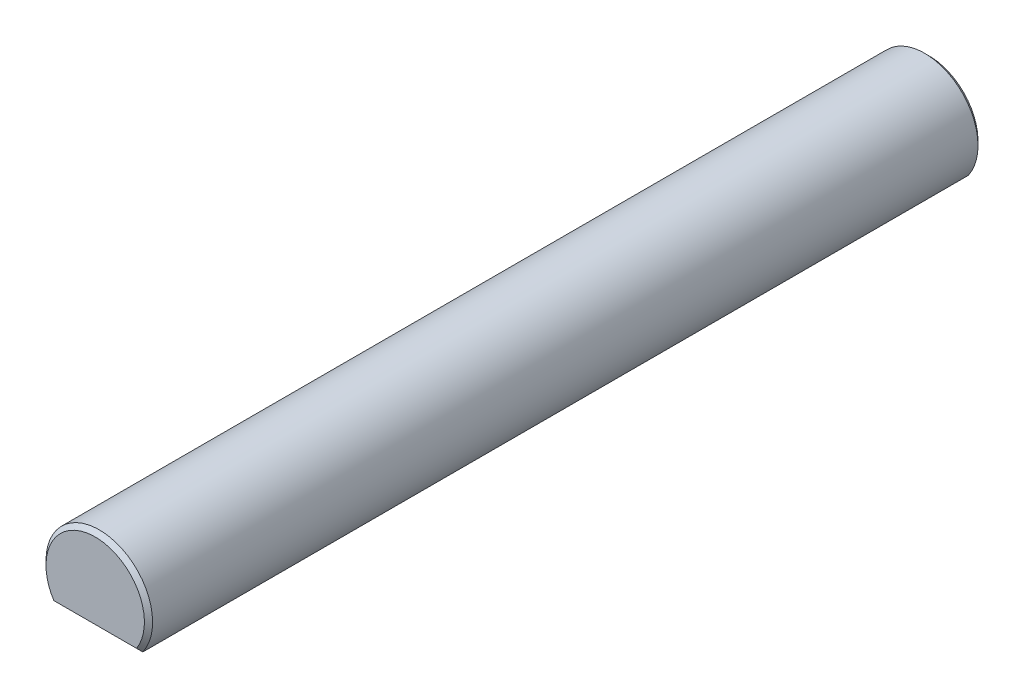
ISO-10303-21;
HEADER;
FILE_DESCRIPTION(('STEP AP214'),'2;1');
FILE_NAME('part.step','',(''),(''),'','','');
FILE_SCHEMA(('AUTOMOTIVE_DESIGN { 1 0 10303 214 1 1 1 1 }'));
ENDSEC;
DATA;
#1=APPLICATION_CONTEXT('core data for automotive mechanical design processes');
#2=APPLICATION_PROTOCOL_DEFINITION('international standard','automotive_design',2000,#1);
#3=PRODUCT_CONTEXT('',#1,'mechanical');
#4=PRODUCT('Part','Part','',(#3));
#5=PRODUCT_RELATED_PRODUCT_CATEGORY('part','',(#4));
#6=PRODUCT_DEFINITION_FORMATION('','',#4);
#7=PRODUCT_DEFINITION_CONTEXT('part definition',#1,'design');
#8=PRODUCT_DEFINITION('design','',#6,#7);
#9=PRODUCT_DEFINITION_SHAPE('','',#8);
#10=(LENGTH_UNIT() NAMED_UNIT(*) SI_UNIT(.MILLI.,.METRE.));
#11=(NAMED_UNIT(*) PLANE_ANGLE_UNIT() SI_UNIT($,.RADIAN.));
#12=(NAMED_UNIT(*) SI_UNIT($,.STERADIAN.) SOLID_ANGLE_UNIT());
#13=UNCERTAINTY_MEASURE_WITH_UNIT(LENGTH_MEASURE(1.E-05),#10,'distance_accuracy_value','');
#14=(GEOMETRIC_REPRESENTATION_CONTEXT(3) GLOBAL_UNCERTAINTY_ASSIGNED_CONTEXT((#13)) GLOBAL_UNIT_ASSIGNED_CONTEXT((#10,
#11,#12)) REPRESENTATION_CONTEXT('',''));
#15=CARTESIAN_POINT('',(0.,0.,0.));
#16=DIRECTION('',(0.,0.,1.));
#17=DIRECTION('',(1.,0.,0.));
#18=AXIS2_PLACEMENT_3D('',#15,#16,#17);
#19=CARTESIAN_POINT('',(0.,0.,122.));
#20=DIRECTION('',(0.,0.,-1.));
#21=DIRECTION('',(-1.,0.,0.));
#22=AXIS2_PLACEMENT_3D('',#19,#20,#21);
#23=CYLINDRICAL_SURFACE('',#22,7.8);
#24=DIRECTION('',(0.,0.,-1.));
#25=VECTOR('',#24,1.);
#26=CARTESIAN_POINT('',(6.37102817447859,-4.5,122.));
#27=LINE('',#26,#25);
#28=CARTESIAN_POINT('',(6.37102817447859,-4.5,121.4));
#29=VERTEX_POINT('',#28);
#30=CARTESIAN_POINT('',(6.37102817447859,-4.5,0.600000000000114));
#31=VERTEX_POINT('',#30);
#32=EDGE_CURVE('E87',#29,#31,#27,.T.);
#33=ORIENTED_EDGE('',*,*,#32,.T.);
#34=CARTESIAN_POINT('',(0.,0.,0.600000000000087));
#35=DIRECTION('',(0.,0.,1.));
#36=DIRECTION('',(1.,0.,0.));
#37=AXIS2_PLACEMENT_3D('',#34,#35,#36);
#38=CIRCLE('',#37,7.8);
#39=CARTESIAN_POINT('',(-6.37102817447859,-4.5,0.600000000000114));
#40=VERTEX_POINT('',#39);
#41=EDGE_CURVE('E92',#31,#40,#38,.T.);
#42=ORIENTED_EDGE('',*,*,#41,.T.);
#43=DIRECTION('',(0.,0.,-1.));
#44=VECTOR('',#43,1.);
#45=CARTESIAN_POINT('',(-6.37102817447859,-4.5,122.));
#46=LINE('',#45,#44);
#47=CARTESIAN_POINT('',(-6.37102817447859,-4.5,121.4));
#48=VERTEX_POINT('',#47);
#49=EDGE_CURVE('E89',#48,#40,#46,.T.);
#50=ORIENTED_EDGE('',*,*,#49,.F.);
#51=CARTESIAN_POINT('',(0.,0.,121.4));
#52=DIRECTION('',(0.,0.,1.));
#53=DIRECTION('',(1.,0.,0.));
#54=AXIS2_PLACEMENT_3D('',#51,#52,#53);
#55=CIRCLE('',#54,7.8);
#56=EDGE_CURVE('E85',#48,#29,#55,.F.);
#57=ORIENTED_EDGE('',*,*,#56,.T.);
#58=EDGE_LOOP('',(#33,#42,#50,#57));
#59=FACE_BOUND('',#58,.T.);
#60=ADVANCED_FACE('F35',(#59),#23,.T.);
#61=CARTESIAN_POINT('',(-6.37102817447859,-4.5,122.));
#62=DIRECTION('',(0.,1.,0.));
#63=DIRECTION('',(0.,0.,1.));
#64=AXIS2_PLACEMENT_3D('',#61,#62,#63);
#65=PLANE('',#64);
#66=ORIENTED_EDGE('',*,*,#49,.T.);
#67=DIRECTION('',(1.,0.,0.));
#68=VECTOR('',#67,1.);
#69=CARTESIAN_POINT('',(-6.37102817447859,-4.5,0.600000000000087));
#70=LINE('',#69,#68);
#71=EDGE_CURVE('E100',#40,#31,#70,.T.);
#72=ORIENTED_EDGE('',*,*,#71,.T.);
#73=ORIENTED_EDGE('',*,*,#32,.F.);
#74=DIRECTION('',(-1.,0.,0.));
#75=VECTOR('',#74,1.);
#76=CARTESIAN_POINT('',(-6.37102817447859,-4.5,121.4));
#77=LINE('',#76,#75);
#78=EDGE_CURVE('E98',#29,#48,#77,.T.);
#79=ORIENTED_EDGE('',*,*,#78,.T.);
#80=EDGE_LOOP('',(#66,#72,#73,#79));
#81=FACE_BOUND('',#80,.T.);
#82=ADVANCED_FACE('F97',(#81),#65,.F.);
#83=CARTESIAN_POINT('',(0.,0.,122.));
#84=DIRECTION('',(0.,0.,1.));
#85=DIRECTION('',(1.,0.,0.));
#86=AXIS2_PLACEMENT_3D('',#83,#84,#85);
#87=PLANE('',#86);
#88=CARTESIAN_POINT('',(0.,0.,122.));
#89=DIRECTION('',(0.,0.,1.));
#90=DIRECTION('',(1.,0.,0.));
#91=AXIS2_PLACEMENT_3D('',#88,#89,#90);
#92=CIRCLE('',#91,7.20000000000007);
#93=CARTESIAN_POINT('',(6.05227230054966,-3.90000000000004,122.));
#94=VERTEX_POINT('',#93);
#95=CARTESIAN_POINT('',(-6.05227230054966,-3.90000000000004,122.));
#96=VERTEX_POINT('',#95);
#97=EDGE_CURVE('E50',#94,#96,#92,.T.);
#98=ORIENTED_EDGE('',*,*,#97,.T.);
#99=DIRECTION('',(1.,0.,0.));
#100=VECTOR('',#99,1.);
#101=CARTESIAN_POINT('',(6.37102817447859,-3.90000000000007,122.));
#102=LINE('',#101,#100);
#103=EDGE_CURVE('E11',#96,#94,#102,.T.);
#104=ORIENTED_EDGE('',*,*,#103,.T.);
#105=EDGE_LOOP('',(#98,#104));
#106=FACE_BOUND('',#105,.T.);
#107=ADVANCED_FACE('F157',(#106),#87,.T.);
#108=CARTESIAN_POINT('',(0.,0.,0.));
#109=DIRECTION('',(0.,0.,1.));
#110=DIRECTION('',(1.,0.,0.));
#111=AXIS2_PLACEMENT_3D('',#108,#109,#110);
#112=PLANE('',#111);
#113=CARTESIAN_POINT('',(0.,0.,0.));
#114=DIRECTION('',(0.,0.,1.));
#115=DIRECTION('',(1.,0.,0.));
#116=AXIS2_PLACEMENT_3D('',#113,#114,#115);
#117=CIRCLE('',#116,7.19999999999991);
#118=CARTESIAN_POINT('',(-6.05227230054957,-3.89999999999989,0.));
#119=VERTEX_POINT('',#118);
#120=CARTESIAN_POINT('',(6.05227230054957,-3.89999999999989,0.));
#121=VERTEX_POINT('',#120);
#122=EDGE_CURVE('E145',#119,#121,#117,.F.);
#123=ORIENTED_EDGE('',*,*,#122,.T.);
#124=DIRECTION('',(-1.,0.,0.));
#125=VECTOR('',#124,1.);
#126=CARTESIAN_POINT('',(0.,-3.89999999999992,0.));
#127=LINE('',#126,#125);
#128=EDGE_CURVE('E93',#121,#119,#127,.T.);
#129=ORIENTED_EDGE('',*,*,#128,.T.);
#130=EDGE_LOOP('',(#123,#129));
#131=FACE_BOUND('',#130,.T.);
#132=ADVANCED_FACE('F155',(#131),#112,.F.);
#133=CARTESIAN_POINT('',(0.,0.,0.600000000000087));
#134=DIRECTION('',(0.,0.,1.));
#135=DIRECTION('',(1.,0.,0.));
#136=AXIS2_PLACEMENT_3D('',#133,#134,#135);
#137=CONICAL_SURFACE('',#136,7.8,0.785398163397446);
#138=CARTESIAN_POINT('',(6.37102817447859,-4.5,0.600000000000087));
#139=CARTESIAN_POINT('',(6.31909661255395,-4.39968280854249,0.499682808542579));
#140=CARTESIAN_POINT('',(6.26656786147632,-4.2995242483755,0.399524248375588));
#141=CARTESIAN_POINT('',(6.16031590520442,-4.09952424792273,0.199524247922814));
#142=CARTESIAN_POINT('',(6.10659269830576,-3.99968280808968,0.0996828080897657));
#143=CARTESIAN_POINT('',(6.05227230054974,-3.89999999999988,0.));
#144=B_SPLINE_CURVE_WITH_KNOTS('',3,(#138,#139,#140,#141,#142,#143),.UNSPECIFIED.,.F.,.F.,(4,2,
4),(0.,0.453215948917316,0.906432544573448),.UNSPECIFIED.);
#145=EDGE_CURVE('E105',#121,#31,#144,.F.);
#146=ORIENTED_EDGE('',*,*,#145,.F.);
#147=ORIENTED_EDGE('',*,*,#122,.F.);
#148=CARTESIAN_POINT('',(-6.05227230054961,-3.89999999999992,0.));
#149=CARTESIAN_POINT('',(-6.10659269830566,-3.99968280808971,0.0996828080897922));
#150=CARTESIAN_POINT('',(-6.16031590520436,-4.09952424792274,0.199524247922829));
#151=CARTESIAN_POINT('',(-6.26656786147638,-4.29952424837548,0.39952424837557));
#152=CARTESIAN_POINT('',(-6.31909661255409,-4.39968280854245,0.49968280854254));
#153=CARTESIAN_POINT('',(-6.37102817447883,-4.49999999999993,0.60000000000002));
#154=B_SPLINE_CURVE_WITH_KNOTS('',3,(#148,#149,#150,#151,#152,#153),.UNSPECIFIED.,.F.,.F.,(4,2,
4),(0.,0.45321659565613,0.906432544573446),.UNSPECIFIED.);
#155=EDGE_CURVE('E101',#40,#119,#154,.F.);
#156=ORIENTED_EDGE('',*,*,#155,.F.);
#157=ORIENTED_EDGE('',*,*,#41,.F.);
#158=EDGE_LOOP('',(#146,#147,#156,#157));
#159=FACE_BOUND('',#158,.T.);
#160=ADVANCED_FACE('F131',(#159),#137,.T.);
#161=CARTESIAN_POINT('',(-6.37102817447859,-4.5,0.600000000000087));
#162=DIRECTION('',(0.,0.707106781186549,0.707106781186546));
#163=DIRECTION('',(1.,0.,0.));
#164=AXIS2_PLACEMENT_3D('',#161,#162,#163);
#165=PLANE('',#164);
#166=ORIENTED_EDGE('',*,*,#155,.T.);
#167=ORIENTED_EDGE('',*,*,#128,.F.);
#168=ORIENTED_EDGE('',*,*,#145,.T.);
#169=ORIENTED_EDGE('',*,*,#71,.F.);
#170=EDGE_LOOP('',(#166,#167,#168,#169));
#171=FACE_BOUND('',#170,.T.);
#172=ADVANCED_FACE('F123',(#171),#165,.F.);
#173=CARTESIAN_POINT('',(0.,0.,122.));
#174=DIRECTION('',(0.,0.,-1.));
#175=DIRECTION('',(-1.,0.,0.));
#176=AXIS2_PLACEMENT_3D('',#173,#174,#175);
#177=CONICAL_SURFACE('',#176,7.20000000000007,0.785398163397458);
#178=CARTESIAN_POINT('',(6.0522723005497,-3.90000000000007,122.));
#179=CARTESIAN_POINT('',(6.10659269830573,-3.99968280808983,121.90031719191));
#180=CARTESIAN_POINT('',(6.16031590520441,-4.09952424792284,121.800475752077));
#181=CARTESIAN_POINT('',(6.26656786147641,-4.29952424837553,121.600475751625));
#182=CARTESIAN_POINT('',(6.3190966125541,-4.39968280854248,121.500317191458));
#183=CARTESIAN_POINT('',(6.37102817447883,-4.49999999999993,121.4));
#184=B_SPLINE_CURVE_WITH_KNOTS('',3,(#178,#179,#180,#181,#182,#183),.UNSPECIFIED.,.F.,.F.,(4,2,
4),(0.,0.453216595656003,0.906432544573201),.UNSPECIFIED.);
#185=EDGE_CURVE('E63',#29,#94,#184,.F.);
#186=ORIENTED_EDGE('',*,*,#185,.F.);
#187=ORIENTED_EDGE('',*,*,#56,.F.);
#188=CARTESIAN_POINT('',(-6.37102817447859,-4.5,121.4));
#189=CARTESIAN_POINT('',(-6.31909661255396,-4.39968280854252,121.500317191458));
#190=CARTESIAN_POINT('',(-6.26656786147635,-4.29952424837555,121.600475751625));
#191=CARTESIAN_POINT('',(-6.16031590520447,-4.09952424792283,121.800475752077));
#192=CARTESIAN_POINT('',(-6.10659269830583,-3.99968280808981,121.90031719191));
#193=CARTESIAN_POINT('',(-6.05227230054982,-3.90000000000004,122.));
#194=B_SPLINE_CURVE_WITH_KNOTS('',3,(#188,#189,#190,#191,#192,#193),.UNSPECIFIED.,.F.,.F.,(4,2,
4),(0.,0.453215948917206,0.906432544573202),.UNSPECIFIED.);
#195=EDGE_CURVE('E41',#96,#48,#194,.F.);
#196=ORIENTED_EDGE('',*,*,#195,.F.);
#197=ORIENTED_EDGE('',*,*,#97,.F.);
#198=EDGE_LOOP('',(#186,#187,#196,#197));
#199=FACE_BOUND('',#198,.T.);
#200=ADVANCED_FACE('F104',(#199),#177,.T.);
#201=CARTESIAN_POINT('',(0.,-3.90000000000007,122.));
#202=DIRECTION('',(0.,-0.707106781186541,0.707106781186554));
#203=DIRECTION('',(-1.,0.,0.));
#204=AXIS2_PLACEMENT_3D('',#201,#202,#203);
#205=PLANE('',#204);
#206=ORIENTED_EDGE('',*,*,#195,.T.);
#207=ORIENTED_EDGE('',*,*,#78,.F.);
#208=ORIENTED_EDGE('',*,*,#185,.T.);
#209=ORIENTED_EDGE('',*,*,#103,.F.);
#210=EDGE_LOOP('',(#206,#207,#208,#209));
#211=FACE_BOUND('',#210,.T.);
#212=ADVANCED_FACE('F38',(#211),#205,.T.);
#213=CLOSED_SHELL('',(#60,#82,#107,#132,#160,#172,#200,#212));
#214=MANIFOLD_SOLID_BREP('B2',#213);
#215=ADVANCED_BREP_SHAPE_REPRESENTATION('',(#18,#214),#14);
#216=SHAPE_DEFINITION_REPRESENTATION(#9,#215);
ENDSEC;
END-ISO-10303-21;
